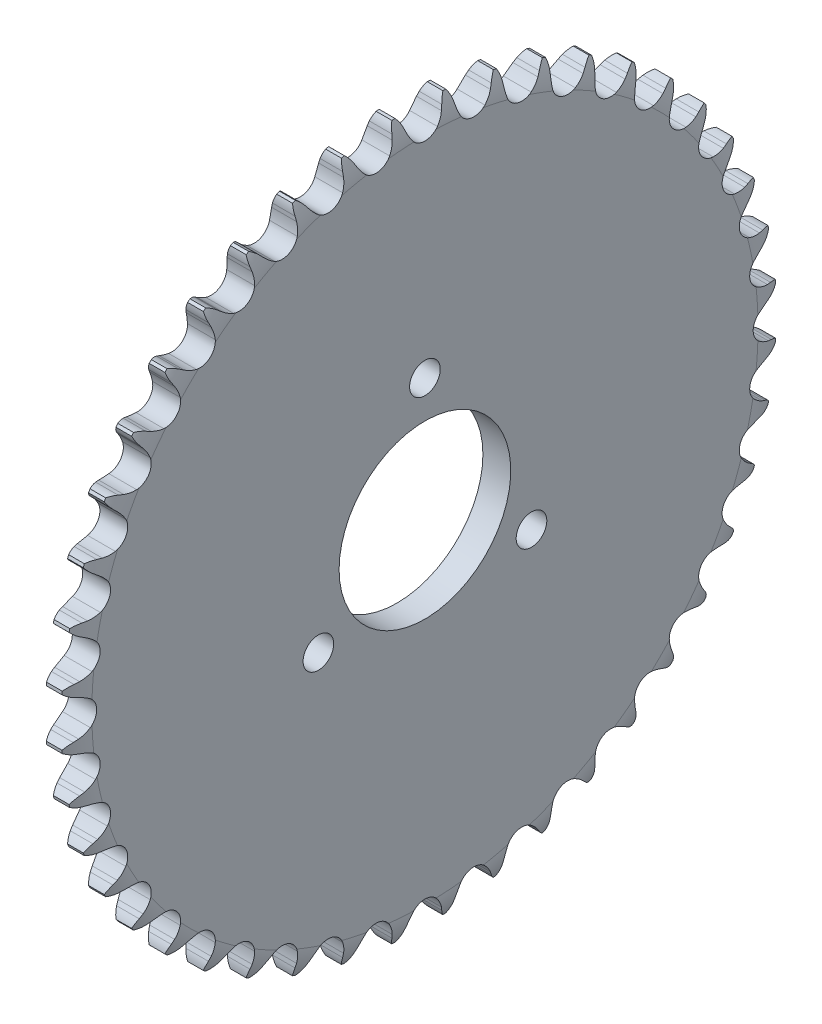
from build123d import *

# Parameters (mm, degrees)
TOOTHCUT_DEPTH  = 132.147302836
TEETHCUTS_COUNT = 44
TEETHCUTS_ANGLE = 351.818181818
BORSKE_R        = 22.225
BORSKE_R_2      = 3.9624
BORE_DEPTH      = 50.8000508


with BuildPart() as part:
    # BasProSke → Base-Revolve (revolve)
    with BuildSketch(Plane(origin=(0, 0, 0), x_dir=(1, 0, 0), z_dir=(0, 1, 0)), mode=Mode.PRIVATE) as base_revolve_sk:
        with BuildLine():
            Line((0, 0), (0, 86.244601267))
            ThreePointArc((0, 86.244601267), (0.399574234, 89.515782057), (1.5748, 92.594601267))
            Line((1.5748, 92.594601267), (5.642864, 92.594601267))
            ThreePointArc((5.642864, 92.594601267), (6.818089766, 89.515782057), (7.217664, 86.244601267))
            Line((7.217664, 86.244601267), (7.217664, 0))
            Line((7.217664, 0), (0, 0))
        make_face()
    revolve(base_revolve_sk.sketch.rotate(Axis((-10, 0, 0), (1, 0, 0)), 180), axis=Axis((-10, 0, 0), (1, 0, 0)))

    # TooCutSke → ToothCut (cut, through all)
    with BuildSketch(Plane(origin=(0, 0, 0), x_dir=(0, 0, -1), z_dir=(1, 0, 0))):
        with BuildLine():
            Line((4.652366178, 89.288810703), (5.038388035, 90.370712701))
            ThreePointArc((5.038388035, 90.370712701), (7.378785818, 93.451027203), (11.066451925, 94.620179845))
            ThreePointArc((11.066451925, 94.620179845), (0, 95.265128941), (-11.066451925, 94.620179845))
            ThreePointArc((-11.066451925, 94.620179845), (-7.378785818, 93.451027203), (-5.038388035, 90.370712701))
            Line((-5.038388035, 90.370712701), (-4.652366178, 89.288810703))
            ThreePointArc((-4.652366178, 89.288810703), (-4.042186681, 87.906536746), (-3.23743768, 86.62771723))
            ThreePointArc((-3.23743768, 86.62771723), (0, 84.991080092), (3.23743768, 86.62771723))
            ThreePointArc((3.23743768, 86.62771723), (4.042186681, 87.906536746), (4.652366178, 89.288810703))
        make_face()
    toothcut = extrude(amount=TOOTHCUT_DEPTH, mode=Mode.SUBTRACT)

    # TeethCuts: ToothCut ×44 about axis
    teethcuts_axis = Axis((-10, 0, 0), (1, 0, 0))
    for i in range(1, TEETHCUTS_COUNT):
        add(toothcut.rotate(teethcuts_axis, i * TEETHCUTS_ANGLE / (TEETHCUTS_COUNT - 1)), mode=Mode.SUBTRACT)

    # BorSke → Bore (cut, symmetric)
    with BuildSketch(Plane(origin=(0, 0, 0), x_dir=(0, 0, -1), z_dir=(1, 0, 0))):
        with Locations(Location((0, 0, 0), (0, 0, 180))):
            Circle(BORSKE_R)
        with Locations(Location((0, 31.8516, 0), (0, 0, 180))):
            Circle(BORSKE_R_2)
        with Locations(Location((-27.584294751, -15.9258, 0), (0, 0, 180))):
            Circle(BORSKE_R_2)
        with Locations(Location((27.584294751, -15.9258, 0), (0, 0, 180))):
            Circle(BORSKE_R_2)
    extrude(amount=BORE_DEPTH, both=True, mode=Mode.SUBTRACT)


solid = part.part
